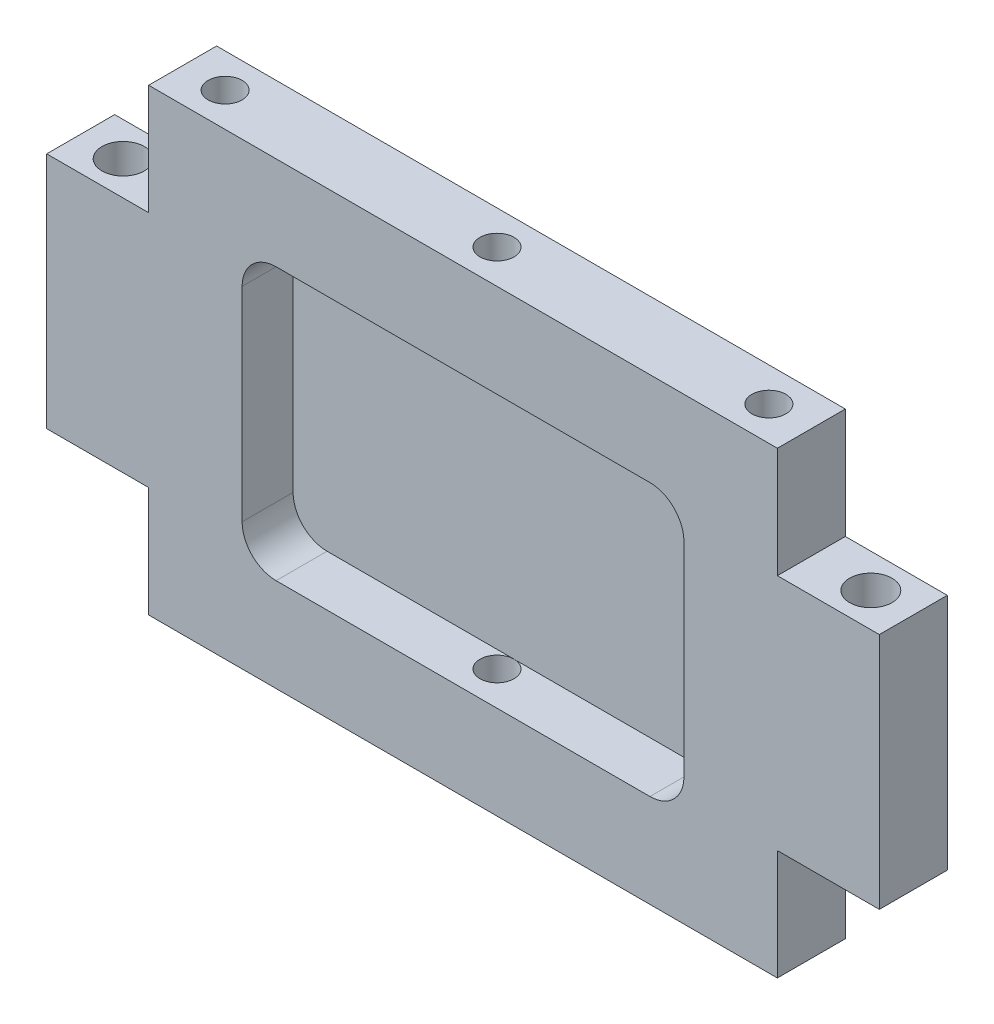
ISO-10303-21;
HEADER;
FILE_DESCRIPTION(('STEP AP214'),'2;1');
FILE_NAME('part.step','',(''),(''),'','','');
FILE_SCHEMA(('AUTOMOTIVE_DESIGN { 1 0 10303 214 1 1 1 1 }'));
ENDSEC;
DATA;
#1=APPLICATION_CONTEXT('core data for automotive mechanical design processes');
#2=APPLICATION_PROTOCOL_DEFINITION('international standard','automotive_design',2000,#1);
#3=PRODUCT_CONTEXT('',#1,'mechanical');
#4=PRODUCT('Part','Part','',(#3));
#5=PRODUCT_RELATED_PRODUCT_CATEGORY('part','',(#4));
#6=PRODUCT_DEFINITION_FORMATION('','',#4);
#7=PRODUCT_DEFINITION_CONTEXT('part definition',#1,'design');
#8=PRODUCT_DEFINITION('design','',#6,#7);
#9=PRODUCT_DEFINITION_SHAPE('','',#8);
#10=(LENGTH_UNIT() NAMED_UNIT(*) SI_UNIT(.MILLI.,.METRE.));
#11=(NAMED_UNIT(*) PLANE_ANGLE_UNIT() SI_UNIT($,.RADIAN.));
#12=(NAMED_UNIT(*) SI_UNIT($,.STERADIAN.) SOLID_ANGLE_UNIT());
#13=UNCERTAINTY_MEASURE_WITH_UNIT(LENGTH_MEASURE(1.E-05),#10,'distance_accuracy_value','');
#14=(GEOMETRIC_REPRESENTATION_CONTEXT(3) GLOBAL_UNCERTAINTY_ASSIGNED_CONTEXT((#13)) GLOBAL_UNIT_ASSIGNED_CONTEXT((#10,
#11,#12)) REPRESENTATION_CONTEXT('',''));
#15=CARTESIAN_POINT('',(0.,0.,0.));
#16=DIRECTION('',(0.,0.,1.));
#17=DIRECTION('',(1.,0.,0.));
#18=AXIS2_PLACEMENT_3D('',#15,#16,#17);
#19=CARTESIAN_POINT('',(0.,0.,6.35));
#20=DIRECTION('',(0.,0.,1.));
#21=DIRECTION('',(1.,0.,0.));
#22=AXIS2_PLACEMENT_3D('',#19,#20,#21);
#23=PLANE('',#22);
#24=DIRECTION('',(0.,-1.,0.));
#25=VECTOR('',#24,1.);
#26=CARTESIAN_POINT('',(-58.7375,-22.2377,6.35));
#27=LINE('',#26,#25);
#28=CARTESIAN_POINT('',(-58.7375,-22.2377,6.35));
#29=VERTEX_POINT('',#28);
#30=CARTESIAN_POINT('',(-58.7375,-42.8625,6.35));
#31=VERTEX_POINT('',#30);
#32=EDGE_CURVE('E236',#29,#31,#27,.T.);
#33=ORIENTED_EDGE('',*,*,#32,.T.);
#34=DIRECTION('',(1.,0.,0.));
#35=VECTOR('',#34,1.);
#36=CARTESIAN_POINT('',(-58.7375,-42.8625,6.35));
#37=LINE('',#36,#35);
#38=CARTESIAN_POINT('',(58.7375,-42.8625,6.35));
#39=VERTEX_POINT('',#38);
#40=EDGE_CURVE('E239',#31,#39,#37,.T.);
#41=ORIENTED_EDGE('',*,*,#40,.T.);
#42=DIRECTION('',(0.,1.,0.));
#43=VECTOR('',#42,1.);
#44=CARTESIAN_POINT('',(58.7375,-42.8625,6.35));
#45=LINE('',#44,#43);
#46=CARTESIAN_POINT('',(58.7375,-22.2377,6.35));
#47=VERTEX_POINT('',#46);
#48=EDGE_CURVE('E242',#39,#47,#45,.T.);
#49=ORIENTED_EDGE('',*,*,#48,.T.);
#50=DIRECTION('',(1.,0.,0.));
#51=VECTOR('',#50,1.);
#52=CARTESIAN_POINT('',(58.7375,-22.2377,6.35));
#53=LINE('',#52,#51);
#54=CARTESIAN_POINT('',(77.7875,-22.2377,6.35));
#55=VERTEX_POINT('',#54);
#56=EDGE_CURVE('E244',#47,#55,#53,.T.);
#57=ORIENTED_EDGE('',*,*,#56,.T.);
#58=DIRECTION('',(0.,1.,0.));
#59=VECTOR('',#58,1.);
#60=CARTESIAN_POINT('',(77.7875,-22.2377,6.35));
#61=LINE('',#60,#59);
#62=CARTESIAN_POINT('',(77.7875,22.2377,6.35));
#63=VERTEX_POINT('',#62);
#64=EDGE_CURVE('E246',#55,#63,#61,.T.);
#65=ORIENTED_EDGE('',*,*,#64,.T.);
#66=DIRECTION('',(-1.,0.,0.));
#67=VECTOR('',#66,1.);
#68=CARTESIAN_POINT('',(77.7875,22.2377,6.35));
#69=LINE('',#68,#67);
#70=CARTESIAN_POINT('',(58.7375,22.2377,6.35));
#71=VERTEX_POINT('',#70);
#72=EDGE_CURVE('E248',#63,#71,#69,.T.);
#73=ORIENTED_EDGE('',*,*,#72,.T.);
#74=DIRECTION('',(0.,1.,0.));
#75=VECTOR('',#74,1.);
#76=CARTESIAN_POINT('',(58.7375,22.2377,6.35));
#77=LINE('',#76,#75);
#78=CARTESIAN_POINT('',(58.7375,42.8625,6.35));
#79=VERTEX_POINT('',#78);
#80=EDGE_CURVE('E250',#71,#79,#77,.T.);
#81=ORIENTED_EDGE('',*,*,#80,.T.);
#82=DIRECTION('',(-1.,0.,0.));
#83=VECTOR('',#82,1.);
#84=CARTESIAN_POINT('',(58.7375,42.8625,6.35));
#85=LINE('',#84,#83);
#86=CARTESIAN_POINT('',(-58.7375,42.8625,6.35));
#87=VERTEX_POINT('',#86);
#88=EDGE_CURVE('E252',#79,#87,#85,.T.);
#89=ORIENTED_EDGE('',*,*,#88,.T.);
#90=DIRECTION('',(0.,-1.,0.));
#91=VECTOR('',#90,1.);
#92=CARTESIAN_POINT('',(-58.7375,42.8625,6.35));
#93=LINE('',#92,#91);
#94=CARTESIAN_POINT('',(-58.7375,22.2377,6.35));
#95=VERTEX_POINT('',#94);
#96=EDGE_CURVE('E254',#87,#95,#93,.T.);
#97=ORIENTED_EDGE('',*,*,#96,.T.);
#98=DIRECTION('',(-1.,0.,0.));
#99=VECTOR('',#98,1.);
#100=CARTESIAN_POINT('',(-58.7375,22.2377,6.35));
#101=LINE('',#100,#99);
#102=CARTESIAN_POINT('',(-77.7875,22.2377,6.35));
#103=VERTEX_POINT('',#102);
#104=EDGE_CURVE('E256',#95,#103,#101,.T.);
#105=ORIENTED_EDGE('',*,*,#104,.T.);
#106=DIRECTION('',(0.,-1.,0.));
#107=VECTOR('',#106,1.);
#108=CARTESIAN_POINT('',(-77.7875,22.2377,6.35));
#109=LINE('',#108,#107);
#110=CARTESIAN_POINT('',(-77.7875,-22.2377,6.35));
#111=VERTEX_POINT('',#110);
#112=EDGE_CURVE('E258',#103,#111,#109,.T.);
#113=ORIENTED_EDGE('',*,*,#112,.T.);
#114=DIRECTION('',(1.,0.,0.));
#115=VECTOR('',#114,1.);
#116=CARTESIAN_POINT('',(-77.7875,-22.2377,6.35));
#117=LINE('',#116,#115);
#118=EDGE_CURVE('E260',#111,#29,#117,.T.);
#119=ORIENTED_EDGE('',*,*,#118,.T.);
#120=EDGE_LOOP('',(#33,#41,#49,#57,#65,#73,#81,#89,#97,#105,#113,#119));
#121=FACE_BOUND('',#120,.T.);
#122=DIRECTION('',(-1.,0.,0.));
#123=VECTOR('',#122,1.);
#124=CARTESIAN_POINT('',(0.,-25.4,6.35));
#125=LINE('',#124,#123);
#126=CARTESIAN_POINT('',(34.925,-25.4,6.35));
#127=VERTEX_POINT('',#126);
#128=CARTESIAN_POINT('',(-34.925,-25.4,6.35));
#129=VERTEX_POINT('',#128);
#130=EDGE_CURVE('E203',#127,#129,#125,.T.);
#131=ORIENTED_EDGE('',*,*,#130,.T.);
#132=CARTESIAN_POINT('',(-34.925,-19.05,6.35));
#133=DIRECTION('',(0.,0.,1.));
#134=DIRECTION('',(1.,0.,0.));
#135=AXIS2_PLACEMENT_3D('',#132,#133,#134);
#136=CIRCLE('',#135,6.35);
#137=CARTESIAN_POINT('',(-41.275,-19.05,6.35));
#138=VERTEX_POINT('',#137);
#139=EDGE_CURVE('E41',#129,#138,#136,.F.);
#140=ORIENTED_EDGE('',*,*,#139,.T.);
#141=DIRECTION('',(0.,1.,0.));
#142=VECTOR('',#141,1.);
#143=CARTESIAN_POINT('',(-41.275,0.,6.35));
#144=LINE('',#143,#142);
#145=CARTESIAN_POINT('',(-41.275,19.05,6.35));
#146=VERTEX_POINT('',#145);
#147=EDGE_CURVE('E334',#138,#146,#144,.T.);
#148=ORIENTED_EDGE('',*,*,#147,.T.);
#149=CARTESIAN_POINT('',(-34.925,19.05,6.35));
#150=DIRECTION('',(0.,0.,1.));
#151=DIRECTION('',(1.,0.,0.));
#152=AXIS2_PLACEMENT_3D('',#149,#150,#151);
#153=CIRCLE('',#152,6.35);
#154=CARTESIAN_POINT('',(-34.925,25.4,6.35));
#155=VERTEX_POINT('',#154);
#156=EDGE_CURVE('E11',#146,#155,#153,.F.);
#157=ORIENTED_EDGE('',*,*,#156,.T.);
#158=DIRECTION('',(1.,0.,0.));
#159=VECTOR('',#158,1.);
#160=CARTESIAN_POINT('',(0.,25.4,6.35));
#161=LINE('',#160,#159);
#162=CARTESIAN_POINT('',(34.925,25.4,6.35));
#163=VERTEX_POINT('',#162);
#164=EDGE_CURVE('E378',#155,#163,#161,.T.);
#165=ORIENTED_EDGE('',*,*,#164,.T.);
#166=CARTESIAN_POINT('',(34.925,19.05,6.35));
#167=DIRECTION('',(0.,0.,1.));
#168=DIRECTION('',(1.,0.,0.));
#169=AXIS2_PLACEMENT_3D('',#166,#167,#168);
#170=CIRCLE('',#169,6.35);
#171=CARTESIAN_POINT('',(41.275,19.05,6.35));
#172=VERTEX_POINT('',#171);
#173=EDGE_CURVE('E363',#163,#172,#170,.F.);
#174=ORIENTED_EDGE('',*,*,#173,.T.);
#175=DIRECTION('',(0.,-1.,0.));
#176=VECTOR('',#175,1.);
#177=CARTESIAN_POINT('',(41.275,0.,6.35));
#178=LINE('',#177,#176);
#179=CARTESIAN_POINT('',(41.275,-19.05,6.35));
#180=VERTEX_POINT('',#179);
#181=EDGE_CURVE('E331',#172,#180,#178,.T.);
#182=ORIENTED_EDGE('',*,*,#181,.T.);
#183=CARTESIAN_POINT('',(34.925,-19.05,6.35));
#184=DIRECTION('',(0.,0.,1.));
#185=DIRECTION('',(1.,0.,0.));
#186=AXIS2_PLACEMENT_3D('',#183,#184,#185);
#187=CIRCLE('',#186,6.35);
#188=EDGE_CURVE('E365',#180,#127,#187,.F.);
#189=ORIENTED_EDGE('',*,*,#188,.T.);
#190=EDGE_LOOP('',(#131,#140,#148,#157,#165,#174,#182,#189));
#191=FACE_BOUND('',#190,.T.);
#192=ADVANCED_FACE('F33',(#121,#191),#23,.T.);
#193=CARTESIAN_POINT('',(0.,-42.8625,0.));
#194=DIRECTION('',(0.,-1.,0.));
#195=DIRECTION('',(0.,0.,-1.));
#196=AXIS2_PLACEMENT_3D('',#193,#194,#195);
#197=CYLINDRICAL_SURFACE('',#196,3.17499999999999);
#198=CARTESIAN_POINT('',(0.,-42.8625,0.));
#199=DIRECTION('',(0.,-1.,0.));
#200=DIRECTION('',(0.,0.,-1.));
#201=AXIS2_PLACEMENT_3D('',#198,#199,#200);
#202=CIRCLE('',#201,3.17499999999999);
#203=CARTESIAN_POINT('',(0.,-42.8625,-3.17499999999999));
#204=VERTEX_POINT('',#203);
#205=EDGE_CURVE('E218',#204,#204,#202,.T.);
#206=ORIENTED_EDGE('',*,*,#205,.T.);
#207=EDGE_LOOP('',(#206));
#208=FACE_BOUND('',#207,.T.);
#209=CARTESIAN_POINT('',(0.,-25.4,0.));
#210=DIRECTION('',(0.,1.,0.));
#211=DIRECTION('',(0.,0.,1.));
#212=AXIS2_PLACEMENT_3D('',#209,#210,#211);
#213=CIRCLE('',#212,3.17499999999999);
#214=CARTESIAN_POINT('',(0.,-25.4,-3.17499999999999));
#215=VERTEX_POINT('',#214);
#216=EDGE_CURVE('E328',#215,#215,#213,.F.);
#217=ORIENTED_EDGE('',*,*,#216,.F.);
#218=EDGE_LOOP('',(#217));
#219=FACE_BOUND('',#218,.T.);
#220=ADVANCED_FACE('F417',(#208,#219),#197,.F.);
#221=CARTESIAN_POINT('',(0.,42.8625,0.));
#222=DIRECTION('',(0.,1.,0.));
#223=DIRECTION('',(0.,0.,1.));
#224=AXIS2_PLACEMENT_3D('',#221,#222,#223);
#225=CYLINDRICAL_SURFACE('',#224,3.17499999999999);
#226=CARTESIAN_POINT('',(0.,42.8625,0.));
#227=DIRECTION('',(0.,1.,0.));
#228=DIRECTION('',(0.,0.,1.));
#229=AXIS2_PLACEMENT_3D('',#226,#227,#228);
#230=CIRCLE('',#229,3.17499999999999);
#231=CARTESIAN_POINT('',(0.,42.8625,3.17499999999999));
#232=VERTEX_POINT('',#231);
#233=EDGE_CURVE('E196',#232,#232,#230,.T.);
#234=ORIENTED_EDGE('',*,*,#233,.T.);
#235=EDGE_LOOP('',(#234));
#236=FACE_BOUND('',#235,.T.);
#237=CARTESIAN_POINT('',(0.,25.4,0.));
#238=DIRECTION('',(0.,-1.,0.));
#239=DIRECTION('',(0.,0.,-1.));
#240=AXIS2_PLACEMENT_3D('',#237,#238,#239);
#241=CIRCLE('',#240,3.17499999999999);
#242=CARTESIAN_POINT('',(0.,25.4,-3.17499999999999));
#243=VERTEX_POINT('',#242);
#244=EDGE_CURVE('E321',#243,#243,#241,.F.);
#245=ORIENTED_EDGE('',*,*,#244,.F.);
#246=EDGE_LOOP('',(#245));
#247=FACE_BOUND('',#246,.T.);
#248=ADVANCED_FACE('F419',(#236,#247),#225,.F.);
#249=CARTESIAN_POINT('',(-58.7375,-22.2377,6.35));
#250=DIRECTION('',(1.,0.,0.));
#251=DIRECTION('',(0.,1.,0.));
#252=AXIS2_PLACEMENT_3D('',#249,#250,#251);
#253=PLANE('',#252);
#254=DIRECTION('',(0.,-1.,0.));
#255=VECTOR('',#254,1.);
#256=CARTESIAN_POINT('',(-58.7375,-22.2377,-6.35));
#257=LINE('',#256,#255);
#258=CARTESIAN_POINT('',(-58.7375,-22.2377,-6.35));
#259=VERTEX_POINT('',#258);
#260=CARTESIAN_POINT('',(-58.7375,-42.8625,-6.35));
#261=VERTEX_POINT('',#260);
#262=EDGE_CURVE('E235',#259,#261,#257,.T.);
#263=ORIENTED_EDGE('',*,*,#262,.T.);
#264=DIRECTION('',(0.,0.,-1.));
#265=VECTOR('',#264,1.);
#266=CARTESIAN_POINT('',(-58.7375,-42.8625,6.35));
#267=LINE('',#266,#265);
#268=EDGE_CURVE('E318',#31,#261,#267,.T.);
#269=ORIENTED_EDGE('',*,*,#268,.F.);
#270=ORIENTED_EDGE('',*,*,#32,.F.);
#271=DIRECTION('',(0.,0.,-1.));
#272=VECTOR('',#271,1.);
#273=CARTESIAN_POINT('',(-58.7375,-22.2377,6.35));
#274=LINE('',#273,#272);
#275=EDGE_CURVE('E262',#29,#259,#274,.T.);
#276=ORIENTED_EDGE('',*,*,#275,.T.);
#277=EDGE_LOOP('',(#263,#269,#270,#276));
#278=FACE_BOUND('',#277,.T.);
#279=ADVANCED_FACE('F426',(#278),#253,.F.);
#280=CARTESIAN_POINT('',(-58.7375,-42.8625,6.35));
#281=DIRECTION('',(0.,1.,0.));
#282=DIRECTION('',(0.,0.,1.));
#283=AXIS2_PLACEMENT_3D('',#280,#281,#282);
#284=PLANE('',#283);
#285=CARTESIAN_POINT('',(-50.8,-42.8625,0.));
#286=DIRECTION('',(0.,-1.,0.));
#287=DIRECTION('',(0.,0.,-1.));
#288=AXIS2_PLACEMENT_3D('',#285,#286,#287);
#289=CIRCLE('',#288,3.17499999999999);
#290=CARTESIAN_POINT('',(-50.8,-42.8625,-3.17499999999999));
#291=VERTEX_POINT('',#290);
#292=EDGE_CURVE('E212',#291,#291,#289,.T.);
#293=ORIENTED_EDGE('',*,*,#292,.F.);
#294=EDGE_LOOP('',(#293));
#295=FACE_BOUND('',#294,.T.);
#296=ORIENTED_EDGE('',*,*,#205,.F.);
#297=EDGE_LOOP('',(#296));
#298=FACE_BOUND('',#297,.T.);
#299=CARTESIAN_POINT('',(50.8,-42.8625,0.));
#300=DIRECTION('',(0.,-1.,0.));
#301=DIRECTION('',(0.,0.,-1.));
#302=AXIS2_PLACEMENT_3D('',#299,#300,#301);
#303=CIRCLE('',#302,3.17499999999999);
#304=CARTESIAN_POINT('',(50.8,-42.8625,-3.17499999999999));
#305=VERTEX_POINT('',#304);
#306=EDGE_CURVE('E221',#305,#305,#303,.T.);
#307=ORIENTED_EDGE('',*,*,#306,.F.);
#308=EDGE_LOOP('',(#307));
#309=FACE_BOUND('',#308,.T.);
#310=DIRECTION('',(1.,0.,0.));
#311=VECTOR('',#310,1.);
#312=CARTESIAN_POINT('',(-58.7375,-42.8625,-6.35));
#313=LINE('',#312,#311);
#314=CARTESIAN_POINT('',(58.7375,-42.8625,-6.35));
#315=VERTEX_POINT('',#314);
#316=EDGE_CURVE('E265',#261,#315,#313,.T.);
#317=ORIENTED_EDGE('',*,*,#316,.T.);
#318=DIRECTION('',(0.,0.,-1.));
#319=VECTOR('',#318,1.);
#320=CARTESIAN_POINT('',(58.7375,-42.8625,6.35));
#321=LINE('',#320,#319);
#322=EDGE_CURVE('E315',#39,#315,#321,.T.);
#323=ORIENTED_EDGE('',*,*,#322,.F.);
#324=ORIENTED_EDGE('',*,*,#40,.F.);
#325=ORIENTED_EDGE('',*,*,#268,.T.);
#326=EDGE_LOOP('',(#317,#323,#324,#325));
#327=FACE_BOUND('',#326,.T.);
#328=ADVANCED_FACE('F495',(#295,#298,#309,#327),#284,.F.);
#329=CARTESIAN_POINT('',(58.7375,-42.8625,6.35));
#330=DIRECTION('',(-1.,0.,0.));
#331=DIRECTION('',(0.,-1.,0.));
#332=AXIS2_PLACEMENT_3D('',#329,#330,#331);
#333=PLANE('',#332);
#334=DIRECTION('',(0.,1.,0.));
#335=VECTOR('',#334,1.);
#336=CARTESIAN_POINT('',(58.7375,-42.8625,-6.35));
#337=LINE('',#336,#335);
#338=CARTESIAN_POINT('',(58.7375,-22.2377,-6.35));
#339=VERTEX_POINT('',#338);
#340=EDGE_CURVE('E267',#315,#339,#337,.T.);
#341=ORIENTED_EDGE('',*,*,#340,.T.);
#342=DIRECTION('',(0.,0.,-1.));
#343=VECTOR('',#342,1.);
#344=CARTESIAN_POINT('',(58.7375,-22.2377,6.35));
#345=LINE('',#344,#343);
#346=EDGE_CURVE('E312',#47,#339,#345,.T.);
#347=ORIENTED_EDGE('',*,*,#346,.F.);
#348=ORIENTED_EDGE('',*,*,#48,.F.);
#349=ORIENTED_EDGE('',*,*,#322,.T.);
#350=EDGE_LOOP('',(#341,#347,#348,#349));
#351=FACE_BOUND('',#350,.T.);
#352=ADVANCED_FACE('F491',(#351),#333,.F.);
#353=CARTESIAN_POINT('',(58.7375,-22.2377,6.35));
#354=DIRECTION('',(0.,1.,0.));
#355=DIRECTION('',(0.,0.,1.));
#356=AXIS2_PLACEMENT_3D('',#353,#354,#355);
#357=PLANE('',#356);
#358=CARTESIAN_POINT('',(69.85,-22.2377,0.));
#359=DIRECTION('',(0.,1.,0.));
#360=DIRECTION('',(0.,0.,1.));
#361=AXIS2_PLACEMENT_3D('',#358,#359,#360);
#362=CIRCLE('',#361,3.9624);
#363=CARTESIAN_POINT('',(69.85,-22.2377,3.9624));
#364=VERTEX_POINT('',#363);
#365=EDGE_CURVE('E228',#364,#364,#362,.T.);
#366=ORIENTED_EDGE('',*,*,#365,.T.);
#367=EDGE_LOOP('',(#366));
#368=FACE_BOUND('',#367,.T.);
#369=DIRECTION('',(1.,0.,0.));
#370=VECTOR('',#369,1.);
#371=CARTESIAN_POINT('',(58.7375,-22.2377,-6.35));
#372=LINE('',#371,#370);
#373=CARTESIAN_POINT('',(77.7875,-22.2377,-6.35));
#374=VERTEX_POINT('',#373);
#375=EDGE_CURVE('E269',#339,#374,#372,.T.);
#376=ORIENTED_EDGE('',*,*,#375,.T.);
#377=DIRECTION('',(0.,0.,-1.));
#378=VECTOR('',#377,1.);
#379=CARTESIAN_POINT('',(77.7875,-22.2377,6.35));
#380=LINE('',#379,#378);
#381=EDGE_CURVE('E309',#55,#374,#380,.T.);
#382=ORIENTED_EDGE('',*,*,#381,.F.);
#383=ORIENTED_EDGE('',*,*,#56,.F.);
#384=ORIENTED_EDGE('',*,*,#346,.T.);
#385=EDGE_LOOP('',(#376,#382,#383,#384));
#386=FACE_BOUND('',#385,.T.);
#387=ADVANCED_FACE('F487',(#368,#386),#357,.F.);
#388=CARTESIAN_POINT('',(77.7875,-22.2377,6.35));
#389=DIRECTION('',(-1.,0.,0.));
#390=DIRECTION('',(0.,0.,1.));
#391=AXIS2_PLACEMENT_3D('',#388,#389,#390);
#392=PLANE('',#391);
#393=DIRECTION('',(0.,1.,0.));
#394=VECTOR('',#393,1.);
#395=CARTESIAN_POINT('',(77.7875,-22.2377,-6.35));
#396=LINE('',#395,#394);
#397=CARTESIAN_POINT('',(77.7875,22.2377,-6.35));
#398=VERTEX_POINT('',#397);
#399=EDGE_CURVE('E271',#374,#398,#396,.T.);
#400=ORIENTED_EDGE('',*,*,#399,.T.);
#401=DIRECTION('',(0.,0.,-1.));
#402=VECTOR('',#401,1.);
#403=CARTESIAN_POINT('',(77.7875,22.2377,6.35));
#404=LINE('',#403,#402);
#405=EDGE_CURVE('E306',#63,#398,#404,.T.);
#406=ORIENTED_EDGE('',*,*,#405,.F.);
#407=ORIENTED_EDGE('',*,*,#64,.F.);
#408=ORIENTED_EDGE('',*,*,#381,.T.);
#409=EDGE_LOOP('',(#400,#406,#407,#408));
#410=FACE_BOUND('',#409,.T.);
#411=ADVANCED_FACE('F483',(#410),#392,.F.);
#412=CARTESIAN_POINT('',(77.7875,22.2377,6.35));
#413=DIRECTION('',(0.,-1.,0.));
#414=DIRECTION('',(0.,0.,-1.));
#415=AXIS2_PLACEMENT_3D('',#412,#413,#414);
#416=PLANE('',#415);
#417=CARTESIAN_POINT('',(69.85,22.2377,0.));
#418=DIRECTION('',(0.,-1.,0.));
#419=DIRECTION('',(0.,0.,-1.));
#420=AXIS2_PLACEMENT_3D('',#417,#418,#419);
#421=CIRCLE('',#420,3.9624);
#422=CARTESIAN_POINT('',(69.85,22.2377,3.9624));
#423=VERTEX_POINT('',#422);
#424=EDGE_CURVE('E227',#423,#423,#421,.T.);
#425=ORIENTED_EDGE('',*,*,#424,.T.);
#426=EDGE_LOOP('',(#425));
#427=FACE_BOUND('',#426,.T.);
#428=DIRECTION('',(-1.,0.,0.));
#429=VECTOR('',#428,1.);
#430=CARTESIAN_POINT('',(77.7875,22.2377,-6.35));
#431=LINE('',#430,#429);
#432=CARTESIAN_POINT('',(58.7375,22.2377,-6.35));
#433=VERTEX_POINT('',#432);
#434=EDGE_CURVE('E273',#398,#433,#431,.T.);
#435=ORIENTED_EDGE('',*,*,#434,.T.);
#436=DIRECTION('',(0.,0.,-1.));
#437=VECTOR('',#436,1.);
#438=CARTESIAN_POINT('',(58.7375,22.2377,6.35));
#439=LINE('',#438,#437);
#440=EDGE_CURVE('E303',#71,#433,#439,.T.);
#441=ORIENTED_EDGE('',*,*,#440,.F.);
#442=ORIENTED_EDGE('',*,*,#72,.F.);
#443=ORIENTED_EDGE('',*,*,#405,.T.);
#444=EDGE_LOOP('',(#435,#441,#442,#443));
#445=FACE_BOUND('',#444,.T.);
#446=ADVANCED_FACE('F479',(#427,#445),#416,.F.);
#447=CARTESIAN_POINT('',(58.7375,22.2377,6.35));
#448=DIRECTION('',(-1.,0.,0.));
#449=DIRECTION('',(0.,-1.,0.));
#450=AXIS2_PLACEMENT_3D('',#447,#448,#449);
#451=PLANE('',#450);
#452=DIRECTION('',(0.,1.,0.));
#453=VECTOR('',#452,1.);
#454=CARTESIAN_POINT('',(58.7375,22.2377,-6.35));
#455=LINE('',#454,#453);
#456=CARTESIAN_POINT('',(58.7375,42.8625,-6.35));
#457=VERTEX_POINT('',#456);
#458=EDGE_CURVE('E275',#433,#457,#455,.T.);
#459=ORIENTED_EDGE('',*,*,#458,.T.);
#460=DIRECTION('',(0.,0.,-1.));
#461=VECTOR('',#460,1.);
#462=CARTESIAN_POINT('',(58.7375,42.8625,6.35));
#463=LINE('',#462,#461);
#464=EDGE_CURVE('E300',#79,#457,#463,.T.);
#465=ORIENTED_EDGE('',*,*,#464,.F.);
#466=ORIENTED_EDGE('',*,*,#80,.F.);
#467=ORIENTED_EDGE('',*,*,#440,.T.);
#468=EDGE_LOOP('',(#459,#465,#466,#467));
#469=FACE_BOUND('',#468,.T.);
#470=ADVANCED_FACE('F475',(#469),#451,.F.);
#471=CARTESIAN_POINT('',(58.7375,42.8625,6.35));
#472=DIRECTION('',(0.,-1.,0.));
#473=DIRECTION('',(0.,0.,-1.));
#474=AXIS2_PLACEMENT_3D('',#471,#472,#473);
#475=PLANE('',#474);
#476=CARTESIAN_POINT('',(-50.8,42.8625,0.));
#477=DIRECTION('',(0.,1.,0.));
#478=DIRECTION('',(0.,0.,1.));
#479=AXIS2_PLACEMENT_3D('',#476,#477,#478);
#480=CIRCLE('',#479,3.17499999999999);
#481=CARTESIAN_POINT('',(-50.8,42.8625,3.17499999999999));
#482=VERTEX_POINT('',#481);
#483=EDGE_CURVE('E197',#482,#482,#480,.T.);
#484=ORIENTED_EDGE('',*,*,#483,.F.);
#485=EDGE_LOOP('',(#484));
#486=FACE_BOUND('',#485,.T.);
#487=ORIENTED_EDGE('',*,*,#233,.F.);
#488=EDGE_LOOP('',(#487));
#489=FACE_BOUND('',#488,.T.);
#490=CARTESIAN_POINT('',(50.8,42.8625,0.));
#491=DIRECTION('',(0.,1.,0.));
#492=DIRECTION('',(0.,0.,1.));
#493=AXIS2_PLACEMENT_3D('',#490,#491,#492);
#494=CIRCLE('',#493,3.17499999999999);
#495=CARTESIAN_POINT('',(50.8,42.8625,3.17499999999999));
#496=VERTEX_POINT('',#495);
#497=EDGE_CURVE('E200',#496,#496,#494,.T.);
#498=ORIENTED_EDGE('',*,*,#497,.F.);
#499=EDGE_LOOP('',(#498));
#500=FACE_BOUND('',#499,.T.);
#501=DIRECTION('',(-1.,0.,0.));
#502=VECTOR('',#501,1.);
#503=CARTESIAN_POINT('',(58.7375,42.8625,-6.35));
#504=LINE('',#503,#502);
#505=CARTESIAN_POINT('',(-58.7375,42.8625,-6.35));
#506=VERTEX_POINT('',#505);
#507=EDGE_CURVE('E277',#457,#506,#504,.T.);
#508=ORIENTED_EDGE('',*,*,#507,.T.);
#509=DIRECTION('',(0.,0.,-1.));
#510=VECTOR('',#509,1.);
#511=CARTESIAN_POINT('',(-58.7375,42.8625,6.35));
#512=LINE('',#511,#510);
#513=EDGE_CURVE('E297',#87,#506,#512,.T.);
#514=ORIENTED_EDGE('',*,*,#513,.F.);
#515=ORIENTED_EDGE('',*,*,#88,.F.);
#516=ORIENTED_EDGE('',*,*,#464,.T.);
#517=EDGE_LOOP('',(#508,#514,#515,#516));
#518=FACE_BOUND('',#517,.T.);
#519=ADVANCED_FACE('F471',(#486,#489,#500,#518),#475,.F.);
#520=CARTESIAN_POINT('',(-58.7375,42.8625,6.35));
#521=DIRECTION('',(1.,0.,0.));
#522=DIRECTION('',(0.,1.,0.));
#523=AXIS2_PLACEMENT_3D('',#520,#521,#522);
#524=PLANE('',#523);
#525=DIRECTION('',(0.,-1.,0.));
#526=VECTOR('',#525,1.);
#527=CARTESIAN_POINT('',(-58.7375,42.8625,-6.35));
#528=LINE('',#527,#526);
#529=CARTESIAN_POINT('',(-58.7375,22.2377,-6.35));
#530=VERTEX_POINT('',#529);
#531=EDGE_CURVE('E279',#506,#530,#528,.T.);
#532=ORIENTED_EDGE('',*,*,#531,.T.);
#533=DIRECTION('',(0.,0.,-1.));
#534=VECTOR('',#533,1.);
#535=CARTESIAN_POINT('',(-58.7375,22.2377,6.35));
#536=LINE('',#535,#534);
#537=EDGE_CURVE('E294',#95,#530,#536,.T.);
#538=ORIENTED_EDGE('',*,*,#537,.F.);
#539=ORIENTED_EDGE('',*,*,#96,.F.);
#540=ORIENTED_EDGE('',*,*,#513,.T.);
#541=EDGE_LOOP('',(#532,#538,#539,#540));
#542=FACE_BOUND('',#541,.T.);
#543=ADVANCED_FACE('F467',(#542),#524,.F.);
#544=CARTESIAN_POINT('',(-58.7375,22.2377,6.35));
#545=DIRECTION('',(0.,-1.,0.));
#546=DIRECTION('',(1.,0.,0.));
#547=AXIS2_PLACEMENT_3D('',#544,#545,#546);
#548=PLANE('',#547);
#549=CARTESIAN_POINT('',(-69.85,22.2377,0.));
#550=DIRECTION('',(0.,-1.,0.));
#551=DIRECTION('',(1.,0.,0.));
#552=AXIS2_PLACEMENT_3D('',#549,#550,#551);
#553=CIRCLE('',#552,3.9624);
#554=CARTESIAN_POINT('',(-69.85,22.2377,3.9624));
#555=VERTEX_POINT('',#554);
#556=EDGE_CURVE('E232',#555,#555,#553,.T.);
#557=ORIENTED_EDGE('',*,*,#556,.T.);
#558=EDGE_LOOP('',(#557));
#559=FACE_BOUND('',#558,.T.);
#560=DIRECTION('',(-1.,0.,0.));
#561=VECTOR('',#560,1.);
#562=CARTESIAN_POINT('',(-58.7375,22.2377,-6.35));
#563=LINE('',#562,#561);
#564=CARTESIAN_POINT('',(-77.7875,22.2377,-6.35));
#565=VERTEX_POINT('',#564);
#566=EDGE_CURVE('E281',#530,#565,#563,.T.);
#567=ORIENTED_EDGE('',*,*,#566,.T.);
#568=DIRECTION('',(0.,0.,-1.));
#569=VECTOR('',#568,1.);
#570=CARTESIAN_POINT('',(-77.7875,22.2377,6.35));
#571=LINE('',#570,#569);
#572=EDGE_CURVE('E291',#103,#565,#571,.T.);
#573=ORIENTED_EDGE('',*,*,#572,.F.);
#574=ORIENTED_EDGE('',*,*,#104,.F.);
#575=ORIENTED_EDGE('',*,*,#537,.T.);
#576=EDGE_LOOP('',(#567,#573,#574,#575));
#577=FACE_BOUND('',#576,.T.);
#578=ADVANCED_FACE('F463',(#559,#577),#548,.F.);
#579=CARTESIAN_POINT('',(-77.7875,22.2377,6.35));
#580=DIRECTION('',(1.,0.,0.));
#581=DIRECTION('',(0.,0.,-1.));
#582=AXIS2_PLACEMENT_3D('',#579,#580,#581);
#583=PLANE('',#582);
#584=DIRECTION('',(0.,-1.,0.));
#585=VECTOR('',#584,1.);
#586=CARTESIAN_POINT('',(-77.7875,22.2377,-6.35));
#587=LINE('',#586,#585);
#588=CARTESIAN_POINT('',(-77.7875,-22.2377,-6.35));
#589=VERTEX_POINT('',#588);
#590=EDGE_CURVE('E283',#565,#589,#587,.T.);
#591=ORIENTED_EDGE('',*,*,#590,.T.);
#592=DIRECTION('',(0.,0.,-1.));
#593=VECTOR('',#592,1.);
#594=CARTESIAN_POINT('',(-77.7875,-22.2377,6.35));
#595=LINE('',#594,#593);
#596=EDGE_CURVE('E288',#111,#589,#595,.T.);
#597=ORIENTED_EDGE('',*,*,#596,.F.);
#598=ORIENTED_EDGE('',*,*,#112,.F.);
#599=ORIENTED_EDGE('',*,*,#572,.T.);
#600=EDGE_LOOP('',(#591,#597,#598,#599));
#601=FACE_BOUND('',#600,.T.);
#602=ADVANCED_FACE('F459',(#601),#583,.F.);
#603=CARTESIAN_POINT('',(-77.7875,-22.2377,6.35));
#604=DIRECTION('',(0.,1.,0.));
#605=DIRECTION('',(-1.,0.,0.));
#606=AXIS2_PLACEMENT_3D('',#603,#604,#605);
#607=PLANE('',#606);
#608=CARTESIAN_POINT('',(-69.85,-22.2377,0.));
#609=DIRECTION('',(0.,1.,0.));
#610=DIRECTION('',(-1.,0.,0.));
#611=AXIS2_PLACEMENT_3D('',#608,#609,#610);
#612=CIRCLE('',#611,3.9624);
#613=CARTESIAN_POINT('',(-69.85,-22.2377,3.9624));
#614=VERTEX_POINT('',#613);
#615=EDGE_CURVE('E231',#614,#614,#612,.T.);
#616=ORIENTED_EDGE('',*,*,#615,.T.);
#617=EDGE_LOOP('',(#616));
#618=FACE_BOUND('',#617,.T.);
#619=DIRECTION('',(1.,0.,0.));
#620=VECTOR('',#619,1.);
#621=CARTESIAN_POINT('',(-77.7875,-22.2377,-6.35));
#622=LINE('',#621,#620);
#623=EDGE_CURVE('E240',#589,#259,#622,.T.);
#624=ORIENTED_EDGE('',*,*,#623,.T.);
#625=ORIENTED_EDGE('',*,*,#275,.F.);
#626=ORIENTED_EDGE('',*,*,#118,.F.);
#627=ORIENTED_EDGE('',*,*,#596,.T.);
#628=EDGE_LOOP('',(#624,#625,#626,#627));
#629=FACE_BOUND('',#628,.T.);
#630=ADVANCED_FACE('F455',(#618,#629),#607,.F.);
#631=CARTESIAN_POINT('',(0.,0.,-6.35));
#632=DIRECTION('',(0.,0.,1.));
#633=DIRECTION('',(1.,0.,0.));
#634=AXIS2_PLACEMENT_3D('',#631,#632,#633);
#635=PLANE('',#634);
#636=ORIENTED_EDGE('',*,*,#262,.F.);
#637=ORIENTED_EDGE('',*,*,#623,.F.);
#638=ORIENTED_EDGE('',*,*,#590,.F.);
#639=ORIENTED_EDGE('',*,*,#566,.F.);
#640=ORIENTED_EDGE('',*,*,#531,.F.);
#641=ORIENTED_EDGE('',*,*,#507,.F.);
#642=ORIENTED_EDGE('',*,*,#458,.F.);
#643=ORIENTED_EDGE('',*,*,#434,.F.);
#644=ORIENTED_EDGE('',*,*,#399,.F.);
#645=ORIENTED_EDGE('',*,*,#375,.F.);
#646=ORIENTED_EDGE('',*,*,#340,.F.);
#647=ORIENTED_EDGE('',*,*,#316,.F.);
#648=EDGE_LOOP('',(#636,#637,#638,#639,#640,#641,#642,#643,#644,#645,#646,#647));
#649=FACE_BOUND('',#648,.T.);
#650=ADVANCED_FACE('F450',(#649),#635,.F.);
#651=CARTESIAN_POINT('',(-69.85,-38.1,0.));
#652=DIRECTION('',(0.,1.,0.));
#653=DIRECTION('',(0.,0.,1.));
#654=AXIS2_PLACEMENT_3D('',#651,#652,#653);
#655=CYLINDRICAL_SURFACE('',#654,3.9624);
#656=CARTESIAN_POINT('',(-69.85,-22.2377,3.9624));
#657=CARTESIAN_POINT('',(-69.85,-21.7744145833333,3.9624));
#658=CARTESIAN_POINT('',(-69.85,-21.3111291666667,3.9624));
#659=CARTESIAN_POINT('',(-69.85,-20.3845583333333,3.9624));
#660=CARTESIAN_POINT('',(-69.85,-19.9212729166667,3.9624));
#661=CARTESIAN_POINT('',(-69.85,-18.9947020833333,3.9624));
#662=CARTESIAN_POINT('',(-69.85,-18.5314166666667,3.9624));
#663=CARTESIAN_POINT('',(-69.85,-17.6048458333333,3.9624));
#664=CARTESIAN_POINT('',(-69.85,-17.1415604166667,3.9624));
#665=CARTESIAN_POINT('',(-69.85,-16.2149895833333,3.9624));
#666=CARTESIAN_POINT('',(-69.85,-15.7517041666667,3.9624));
#667=CARTESIAN_POINT('',(-69.85,-14.8251333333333,3.9624));
#668=CARTESIAN_POINT('',(-69.85,-14.3618479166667,3.9624));
#669=CARTESIAN_POINT('',(-69.85,-13.4352770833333,3.9624));
#670=CARTESIAN_POINT('',(-69.85,-12.9719916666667,3.9624));
#671=CARTESIAN_POINT('',(-69.85,-12.0454208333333,3.9624));
#672=CARTESIAN_POINT('',(-69.85,-11.5821354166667,3.9624));
#673=CARTESIAN_POINT('',(-69.85,-10.6555645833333,3.9624));
#674=CARTESIAN_POINT('',(-69.85,-10.1922791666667,3.9624));
#675=CARTESIAN_POINT('',(-69.85,-9.26570833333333,3.9624));
#676=CARTESIAN_POINT('',(-69.85,-8.80242291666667,3.9624));
#677=CARTESIAN_POINT('',(-69.85,-7.87585208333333,3.9624));
#678=CARTESIAN_POINT('',(-69.85,-7.41256666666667,3.9624));
#679=CARTESIAN_POINT('',(-69.85,-6.48599583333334,3.9624));
#680=CARTESIAN_POINT('',(-69.85,-6.02271041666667,3.9624));
#681=CARTESIAN_POINT('',(-69.85,-5.09613958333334,3.9624));
#682=CARTESIAN_POINT('',(-69.85,-4.63285416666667,3.9624));
#683=CARTESIAN_POINT('',(-69.85,-3.70628333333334,3.9624));
#684=CARTESIAN_POINT('',(-69.85,-3.24299791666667,3.9624));
#685=CARTESIAN_POINT('',(-69.85,-2.31642708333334,3.9624));
#686=CARTESIAN_POINT('',(-69.85,-1.85314166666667,3.9624));
#687=CARTESIAN_POINT('',(-69.85,-0.926570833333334,3.9624));
#688=CARTESIAN_POINT('',(-69.85,-0.463285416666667,3.9624));
#689=CARTESIAN_POINT('',(-69.85,0.463285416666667,3.9624));
#690=CARTESIAN_POINT('',(-69.85,0.926570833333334,3.9624));
#691=CARTESIAN_POINT('',(-69.85,1.85314166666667,3.9624));
#692=CARTESIAN_POINT('',(-69.85,2.31642708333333,3.9624));
#693=CARTESIAN_POINT('',(-69.85,3.24299791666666,3.9624));
#694=CARTESIAN_POINT('',(-69.85,3.70628333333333,3.9624));
#695=CARTESIAN_POINT('',(-69.85,4.63285416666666,3.9624));
#696=CARTESIAN_POINT('',(-69.85,5.09613958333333,3.9624));
#697=CARTESIAN_POINT('',(-69.85,6.02271041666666,3.9624));
#698=CARTESIAN_POINT('',(-69.85,6.48599583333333,3.9624));
#699=CARTESIAN_POINT('',(-69.85,7.41256666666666,3.9624));
#700=CARTESIAN_POINT('',(-69.85,7.87585208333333,3.9624));
#701=CARTESIAN_POINT('',(-69.85,8.80242291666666,3.9624));
#702=CARTESIAN_POINT('',(-69.85,9.26570833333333,3.9624));
#703=CARTESIAN_POINT('',(-69.85,10.1922791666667,3.9624));
#704=CARTESIAN_POINT('',(-69.85,10.6555645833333,3.9624));
#705=CARTESIAN_POINT('',(-69.85,11.5821354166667,3.9624));
#706=CARTESIAN_POINT('',(-69.85,12.0454208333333,3.9624));
#707=CARTESIAN_POINT('',(-69.85,12.9719916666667,3.9624));
#708=CARTESIAN_POINT('',(-69.85,13.4352770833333,3.9624));
#709=CARTESIAN_POINT('',(-69.85,14.3618479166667,3.9624));
#710=CARTESIAN_POINT('',(-69.85,14.8251333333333,3.9624));
#711=CARTESIAN_POINT('',(-69.85,15.7517041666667,3.9624));
#712=CARTESIAN_POINT('',(-69.85,16.2149895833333,3.9624));
#713=CARTESIAN_POINT('',(-69.85,17.1415604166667,3.9624));
#714=CARTESIAN_POINT('',(-69.85,17.6048458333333,3.9624));
#715=CARTESIAN_POINT('',(-69.85,18.5314166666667,3.9624));
#716=CARTESIAN_POINT('',(-69.85,18.9947020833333,3.9624));
#717=CARTESIAN_POINT('',(-69.85,19.9212729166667,3.9624));
#718=CARTESIAN_POINT('',(-69.85,20.3845583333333,3.9624));
#719=CARTESIAN_POINT('',(-69.85,21.3111291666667,3.9624));
#720=CARTESIAN_POINT('',(-69.85,21.7744145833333,3.9624));
#721=CARTESIAN_POINT('',(-69.85,22.2377,3.9624));
#722=B_SPLINE_CURVE_WITH_KNOTS('',3,(#656,#657,#658,#659,#660,#661,#662,#663,#664,#665,#666,
#667,#668,#669,#670,#671,#672,#673,#674,#675,#676,#677,#678,#679,#680,#681,#682,#683,#684,#685,
#686,#687,#688,#689,#690,#691,#692,#693,#694,#695,#696,#697,#698,#699,#700,#701,#702,#703,#704,
#705,#706,#707,#708,#709,#710,#711,#712,#713,#714,#715,#716,#717,#718,#719,#720,#721),
.UNSPECIFIED.,.F.,.F.,(4,2,2,2,2,2,2,2,2,2,2,2,2,2,2,2,2,2,2,2,2,2,2,2,2,2,2,2,2,2,2,2,4),(0.,
1.38985625,2.7797125,4.16956875,5.559425,6.94928125,8.3391375,9.72899375,11.11885,12.50870625,
13.8985625,15.28841875,16.678275,18.06813125,19.4579875,20.84784375,22.2377,23.62755625,
25.0174125,26.40726875,27.797125,29.18698125,30.5768375,31.96669375,33.35655,34.74640625,
36.1362625,37.52611875,38.915975,40.30583125,41.6956875,43.08554375,44.4754),.UNSPECIFIED.);
#723=EDGE_CURVE('BSEAM447',#614,#555,#722,.T.);
#724=ORIENTED_EDGE('',*,*,#615,.F.);
#725=ORIENTED_EDGE('',*,*,#556,.F.);
#726=ORIENTED_EDGE('',*,*,#723,.T.);
#727=ORIENTED_EDGE('',*,*,#723,.F.);
#728=EDGE_LOOP('',(#724,#726,#725,#727));
#729=FACE_BOUND('',#728,.T.);
#730=ADVANCED_FACE('F447',(#729),#655,.F.);
#731=CARTESIAN_POINT('',(69.85,-38.1,0.));
#732=DIRECTION('',(0.,1.,0.));
#733=DIRECTION('',(0.,0.,1.));
#734=AXIS2_PLACEMENT_3D('',#731,#732,#733);
#735=CYLINDRICAL_SURFACE('',#734,3.9624);
#736=CARTESIAN_POINT('',(69.85,22.2377,3.9624));
#737=CARTESIAN_POINT('',(69.85,21.7744145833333,3.9624));
#738=CARTESIAN_POINT('',(69.85,21.3111291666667,3.9624));
#739=CARTESIAN_POINT('',(69.85,20.3845583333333,3.9624));
#740=CARTESIAN_POINT('',(69.85,19.9212729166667,3.9624));
#741=CARTESIAN_POINT('',(69.85,18.9947020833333,3.9624));
#742=CARTESIAN_POINT('',(69.85,18.5314166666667,3.9624));
#743=CARTESIAN_POINT('',(69.85,17.6048458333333,3.9624));
#744=CARTESIAN_POINT('',(69.85,17.1415604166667,3.9624));
#745=CARTESIAN_POINT('',(69.85,16.2149895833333,3.9624));
#746=CARTESIAN_POINT('',(69.85,15.7517041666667,3.9624));
#747=CARTESIAN_POINT('',(69.85,14.8251333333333,3.9624));
#748=CARTESIAN_POINT('',(69.85,14.3618479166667,3.9624));
#749=CARTESIAN_POINT('',(69.85,13.4352770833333,3.9624));
#750=CARTESIAN_POINT('',(69.85,12.9719916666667,3.9624));
#751=CARTESIAN_POINT('',(69.85,12.0454208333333,3.9624));
#752=CARTESIAN_POINT('',(69.85,11.5821354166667,3.9624));
#753=CARTESIAN_POINT('',(69.85,10.6555645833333,3.9624));
#754=CARTESIAN_POINT('',(69.85,10.1922791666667,3.9624));
#755=CARTESIAN_POINT('',(69.85,9.26570833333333,3.9624));
#756=CARTESIAN_POINT('',(69.85,8.80242291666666,3.9624));
#757=CARTESIAN_POINT('',(69.85,7.87585208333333,3.9624));
#758=CARTESIAN_POINT('',(69.85,7.41256666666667,3.9624));
#759=CARTESIAN_POINT('',(69.85,6.48599583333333,3.9624));
#760=CARTESIAN_POINT('',(69.85,6.02271041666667,3.9624));
#761=CARTESIAN_POINT('',(69.85,5.09613958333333,3.9624));
#762=CARTESIAN_POINT('',(69.85,4.63285416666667,3.9624));
#763=CARTESIAN_POINT('',(69.85,3.70628333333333,3.9624));
#764=CARTESIAN_POINT('',(69.85,3.24299791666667,3.9624));
#765=CARTESIAN_POINT('',(69.85,2.31642708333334,3.9624));
#766=CARTESIAN_POINT('',(69.85,1.85314166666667,3.9624));
#767=CARTESIAN_POINT('',(69.85,0.926570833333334,3.9624));
#768=CARTESIAN_POINT('',(69.85,0.463285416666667,3.9624));
#769=CARTESIAN_POINT('',(69.85,-0.463285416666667,3.9624));
#770=CARTESIAN_POINT('',(69.85,-0.926570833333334,3.9624));
#771=CARTESIAN_POINT('',(69.85,-1.85314166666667,3.9624));
#772=CARTESIAN_POINT('',(69.85,-2.31642708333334,3.9624));
#773=CARTESIAN_POINT('',(69.85,-3.24299791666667,3.9624));
#774=CARTESIAN_POINT('',(69.85,-3.70628333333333,3.9624));
#775=CARTESIAN_POINT('',(69.85,-4.63285416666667,3.9624));
#776=CARTESIAN_POINT('',(69.85,-5.09613958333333,3.9624));
#777=CARTESIAN_POINT('',(69.85,-6.02271041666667,3.9624));
#778=CARTESIAN_POINT('',(69.85,-6.48599583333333,3.9624));
#779=CARTESIAN_POINT('',(69.85,-7.41256666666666,3.9624));
#780=CARTESIAN_POINT('',(69.85,-7.87585208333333,3.9624));
#781=CARTESIAN_POINT('',(69.85,-8.80242291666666,3.9624));
#782=CARTESIAN_POINT('',(69.85,-9.26570833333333,3.9624));
#783=CARTESIAN_POINT('',(69.85,-10.1922791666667,3.9624));
#784=CARTESIAN_POINT('',(69.85,-10.6555645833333,3.9624));
#785=CARTESIAN_POINT('',(69.85,-11.5821354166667,3.9624));
#786=CARTESIAN_POINT('',(69.85,-12.0454208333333,3.9624));
#787=CARTESIAN_POINT('',(69.85,-12.9719916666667,3.9624));
#788=CARTESIAN_POINT('',(69.85,-13.4352770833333,3.9624));
#789=CARTESIAN_POINT('',(69.85,-14.3618479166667,3.9624));
#790=CARTESIAN_POINT('',(69.85,-14.8251333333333,3.9624));
#791=CARTESIAN_POINT('',(69.85,-15.7517041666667,3.9624));
#792=CARTESIAN_POINT('',(69.85,-16.2149895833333,3.9624));
#793=CARTESIAN_POINT('',(69.85,-17.1415604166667,3.9624));
#794=CARTESIAN_POINT('',(69.85,-17.6048458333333,3.9624));
#795=CARTESIAN_POINT('',(69.85,-18.5314166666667,3.9624));
#796=CARTESIAN_POINT('',(69.85,-18.9947020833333,3.9624));
#797=CARTESIAN_POINT('',(69.85,-19.9212729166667,3.9624));
#798=CARTESIAN_POINT('',(69.85,-20.3845583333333,3.9624));
#799=CARTESIAN_POINT('',(69.85,-21.3111291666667,3.9624));
#800=CARTESIAN_POINT('',(69.85,-21.7744145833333,3.9624));
#801=CARTESIAN_POINT('',(69.85,-22.2377,3.9624));
#802=B_SPLINE_CURVE_WITH_KNOTS('',3,(#736,#737,#738,#739,#740,#741,#742,#743,#744,#745,#746,
#747,#748,#749,#750,#751,#752,#753,#754,#755,#756,#757,#758,#759,#760,#761,#762,#763,#764,#765,
#766,#767,#768,#769,#770,#771,#772,#773,#774,#775,#776,#777,#778,#779,#780,#781,#782,#783,#784,
#785,#786,#787,#788,#789,#790,#791,#792,#793,#794,#795,#796,#797,#798,#799,#800,#801),
.UNSPECIFIED.,.F.,.F.,(4,2,2,2,2,2,2,2,2,2,2,2,2,2,2,2,2,2,2,2,2,2,2,2,2,2,2,2,2,2,2,2,4),(0.,
1.38985625,2.7797125,4.16956875,5.559425,6.94928125,8.3391375,9.72899375,11.11885,12.50870625,
13.8985625,15.28841875,16.678275,18.06813125,19.4579875,20.84784375,22.2377,23.62755625,
25.0174125,26.40726875,27.797125,29.18698125,30.5768375,31.96669375,33.35655,34.74640625,
36.1362625,37.52611875,38.915975,40.30583125,41.6956875,43.08554375,44.4754),.UNSPECIFIED.);
#803=EDGE_CURVE('BSEAM443',#423,#364,#802,.T.);
#804=ORIENTED_EDGE('',*,*,#424,.F.);
#805=ORIENTED_EDGE('',*,*,#365,.F.);
#806=ORIENTED_EDGE('',*,*,#803,.T.);
#807=ORIENTED_EDGE('',*,*,#803,.F.);
#808=EDGE_LOOP('',(#804,#806,#805,#807));
#809=FACE_BOUND('',#808,.T.);
#810=ADVANCED_FACE('F443',(#809),#735,.F.);
#811=CARTESIAN_POINT('',(50.8,-23.8125,0.));
#812=DIRECTION('',(0.,-1.,0.));
#813=DIRECTION('',(0.,0.,-1.));
#814=AXIS2_PLACEMENT_3D('',#811,#812,#813);
#815=CONICAL_SURFACE('',#814,3.17499999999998,1.02974425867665);
#816=CARTESIAN_POINT('',(50.8,-21.9047675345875,0.));
#817=VERTEX_POINT('',#816);
#818=VERTEX_LOOP('',#817);
#819=FACE_BOUND('',#818,.T.);
#820=CARTESIAN_POINT('',(50.8,-23.8125,0.));
#821=DIRECTION('',(0.,-1.,0.));
#822=DIRECTION('',(0.,0.,-1.));
#823=AXIS2_PLACEMENT_3D('',#820,#821,#822);
#824=CIRCLE('',#823,3.17499999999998);
#825=CARTESIAN_POINT('',(50.8,-23.8125,-3.17499999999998));
#826=VERTEX_POINT('',#825);
#827=EDGE_CURVE('E224',#826,#826,#824,.T.);
#828=ORIENTED_EDGE('',*,*,#827,.T.);
#829=EDGE_LOOP('',(#828));
#830=FACE_BOUND('',#829,.T.);
#831=ADVANCED_FACE('F439',(#819,#830),#815,.F.);
#832=CARTESIAN_POINT('',(50.8,-42.8625,0.));
#833=DIRECTION('',(0.,-1.,0.));
#834=DIRECTION('',(0.,0.,-1.));
#835=AXIS2_PLACEMENT_3D('',#832,#833,#834);
#836=CYLINDRICAL_SURFACE('',#835,3.17499999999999);
#837=ORIENTED_EDGE('',*,*,#827,.F.);
#838=EDGE_LOOP('',(#837));
#839=FACE_BOUND('',#838,.T.);
#840=ORIENTED_EDGE('',*,*,#306,.T.);
#841=EDGE_LOOP('',(#840));
#842=FACE_BOUND('',#841,.T.);
#843=ADVANCED_FACE('F436',(#839,#842),#836,.F.);
#844=CARTESIAN_POINT('',(-50.8,-23.8125,0.));
#845=DIRECTION('',(0.,-1.,0.));
#846=DIRECTION('',(0.,0.,-1.));
#847=AXIS2_PLACEMENT_3D('',#844,#845,#846);
#848=CONICAL_SURFACE('',#847,3.17499999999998,1.02974425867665);
#849=CARTESIAN_POINT('',(-50.8,-21.9047675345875,0.));
#850=VERTEX_POINT('',#849);
#851=VERTEX_LOOP('',#850);
#852=FACE_BOUND('',#851,.T.);
#853=CARTESIAN_POINT('',(-50.8,-23.8125,0.));
#854=DIRECTION('',(0.,-1.,0.));
#855=DIRECTION('',(0.,0.,-1.));
#856=AXIS2_PLACEMENT_3D('',#853,#854,#855);
#857=CIRCLE('',#856,3.17499999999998);
#858=CARTESIAN_POINT('',(-50.8,-23.8125,-3.17499999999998));
#859=VERTEX_POINT('',#858);
#860=EDGE_CURVE('E215',#859,#859,#857,.T.);
#861=ORIENTED_EDGE('',*,*,#860,.T.);
#862=EDGE_LOOP('',(#861));
#863=FACE_BOUND('',#862,.T.);
#864=ADVANCED_FACE('F434',(#852,#863),#848,.F.);
#865=CARTESIAN_POINT('',(-50.8,-42.8625,0.));
#866=DIRECTION('',(0.,-1.,0.));
#867=DIRECTION('',(0.,0.,-1.));
#868=AXIS2_PLACEMENT_3D('',#865,#866,#867);
#869=CYLINDRICAL_SURFACE('',#868,3.17499999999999);
#870=ORIENTED_EDGE('',*,*,#860,.F.);
#871=EDGE_LOOP('',(#870));
#872=FACE_BOUND('',#871,.T.);
#873=ORIENTED_EDGE('',*,*,#292,.T.);
#874=EDGE_LOOP('',(#873));
#875=FACE_BOUND('',#874,.T.);
#876=ADVANCED_FACE('F616',(#872,#875),#869,.F.);
#877=CARTESIAN_POINT('',(50.8,23.8125,0.));
#878=DIRECTION('',(0.,1.,0.));
#879=DIRECTION('',(0.,0.,1.));
#880=AXIS2_PLACEMENT_3D('',#877,#878,#879);
#881=CONICAL_SURFACE('',#880,3.17499999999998,1.02974425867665);
#882=CARTESIAN_POINT('',(50.8,21.9047675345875,0.));
#883=VERTEX_POINT('',#882);
#884=VERTEX_LOOP('',#883);
#885=FACE_BOUND('',#884,.T.);
#886=CARTESIAN_POINT('',(50.8,23.8125,0.));
#887=DIRECTION('',(0.,1.,0.));
#888=DIRECTION('',(0.,0.,1.));
#889=AXIS2_PLACEMENT_3D('',#886,#887,#888);
#890=CIRCLE('',#889,3.17499999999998);
#891=CARTESIAN_POINT('',(50.8,23.8125,3.17499999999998));
#892=VERTEX_POINT('',#891);
#893=EDGE_CURVE('E209',#892,#892,#890,.T.);
#894=ORIENTED_EDGE('',*,*,#893,.T.);
#895=EDGE_LOOP('',(#894));
#896=FACE_BOUND('',#895,.T.);
#897=ADVANCED_FACE('F607',(#885,#896),#881,.F.);
#898=CARTESIAN_POINT('',(50.8,42.8625,0.));
#899=DIRECTION('',(0.,1.,0.));
#900=DIRECTION('',(0.,0.,1.));
#901=AXIS2_PLACEMENT_3D('',#898,#899,#900);
#902=CYLINDRICAL_SURFACE('',#901,3.17499999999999);
#903=ORIENTED_EDGE('',*,*,#893,.F.);
#904=EDGE_LOOP('',(#903));
#905=FACE_BOUND('',#904,.T.);
#906=ORIENTED_EDGE('',*,*,#497,.T.);
#907=EDGE_LOOP('',(#906));
#908=FACE_BOUND('',#907,.T.);
#909=ADVANCED_FACE('F190',(#905,#908),#902,.F.);
#910=CARTESIAN_POINT('',(-50.8,23.8125,0.));
#911=DIRECTION('',(0.,1.,0.));
#912=DIRECTION('',(0.,0.,1.));
#913=AXIS2_PLACEMENT_3D('',#910,#911,#912);
#914=CONICAL_SURFACE('',#913,3.17499999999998,1.02974425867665);
#915=CARTESIAN_POINT('',(-50.8,21.9047675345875,0.));
#916=VERTEX_POINT('',#915);
#917=VERTEX_LOOP('',#916);
#918=FACE_BOUND('',#917,.T.);
#919=CARTESIAN_POINT('',(-50.8,23.8125,0.));
#920=DIRECTION('',(0.,1.,0.));
#921=DIRECTION('',(0.,0.,1.));
#922=AXIS2_PLACEMENT_3D('',#919,#920,#921);
#923=CIRCLE('',#922,3.17499999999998);
#924=CARTESIAN_POINT('',(-50.8,23.8125,3.17499999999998));
#925=VERTEX_POINT('',#924);
#926=EDGE_CURVE('E194',#925,#925,#923,.T.);
#927=ORIENTED_EDGE('',*,*,#926,.T.);
#928=EDGE_LOOP('',(#927));
#929=FACE_BOUND('',#928,.T.);
#930=ADVANCED_FACE('F186',(#918,#929),#914,.F.);
#931=CARTESIAN_POINT('',(-50.8,42.8625,0.));
#932=DIRECTION('',(0.,1.,0.));
#933=DIRECTION('',(0.,0.,1.));
#934=AXIS2_PLACEMENT_3D('',#931,#932,#933);
#935=CYLINDRICAL_SURFACE('',#934,3.17499999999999);
#936=ORIENTED_EDGE('',*,*,#926,.F.);
#937=EDGE_LOOP('',(#936));
#938=FACE_BOUND('',#937,.T.);
#939=ORIENTED_EDGE('',*,*,#483,.T.);
#940=EDGE_LOOP('',(#939));
#941=FACE_BOUND('',#940,.T.);
#942=ADVANCED_FACE('F189',(#938,#941),#935,.F.);
#943=CARTESIAN_POINT('',(-41.275,-25.4,25.4));
#944=DIRECTION('',(0.,1.,0.));
#945=DIRECTION('',(0.,0.,1.));
#946=AXIS2_PLACEMENT_3D('',#943,#944,#945);
#947=PLANE('',#946);
#948=ORIENTED_EDGE('',*,*,#130,.F.);
#949=DIRECTION('',(0.,0.,-1.));
#950=VECTOR('',#949,1.);
#951=CARTESIAN_POINT('',(34.925,-25.4,-3.175));
#952=LINE('',#951,#950);
#953=CARTESIAN_POINT('',(34.925,-25.4,-3.175));
#954=VERTEX_POINT('',#953);
#955=EDGE_CURVE('E356',#127,#954,#952,.T.);
#956=ORIENTED_EDGE('',*,*,#955,.T.);
#957=DIRECTION('',(1.,0.,0.));
#958=VECTOR('',#957,1.);
#959=CARTESIAN_POINT('',(-41.275,-25.4,-3.175));
#960=LINE('',#959,#958);
#961=EDGE_CURVE('E385',#215,#954,#960,.T.);
#962=ORIENTED_EDGE('',*,*,#961,.F.);
#963=ORIENTED_EDGE('',*,*,#216,.T.);
#964=CARTESIAN_POINT('',(-34.925,-25.4,-3.175));
#965=VERTEX_POINT('',#964);
#966=EDGE_CURVE('E389',#965,#215,#960,.T.);
#967=ORIENTED_EDGE('',*,*,#966,.F.);
#968=DIRECTION('',(0.,0.,-1.));
#969=VECTOR('',#968,1.);
#970=CARTESIAN_POINT('',(-34.925,-25.4,6.35));
#971=LINE('',#970,#969);
#972=EDGE_CURVE('E354',#965,#129,#971,.F.);
#973=ORIENTED_EDGE('',*,*,#972,.T.);
#974=EDGE_LOOP('',(#948,#956,#962,#963,#967,#973));
#975=FACE_BOUND('',#974,.T.);
#976=ADVANCED_FACE('F373',(#975),#947,.T.);
#977=CARTESIAN_POINT('',(41.275,25.4,25.4));
#978=DIRECTION('',(0.,-1.,0.));
#979=DIRECTION('',(0.,0.,-1.));
#980=AXIS2_PLACEMENT_3D('',#977,#978,#979);
#981=PLANE('',#980);
#982=DIRECTION('',(-1.,0.,0.));
#983=VECTOR('',#982,1.);
#984=CARTESIAN_POINT('',(41.275,25.4,-3.175));
#985=LINE('',#984,#983);
#986=CARTESIAN_POINT('',(34.925,25.4,-3.175));
#987=VERTEX_POINT('',#986);
#988=EDGE_CURVE('E398',#987,#243,#985,.T.);
#989=ORIENTED_EDGE('',*,*,#988,.F.);
#990=DIRECTION('',(0.,0.,-1.));
#991=VECTOR('',#990,1.);
#992=CARTESIAN_POINT('',(34.925,25.4,6.35));
#993=LINE('',#992,#991);
#994=EDGE_CURVE('E352',#987,#163,#993,.F.);
#995=ORIENTED_EDGE('',*,*,#994,.T.);
#996=ORIENTED_EDGE('',*,*,#164,.F.);
#997=DIRECTION('',(0.,0.,-1.));
#998=VECTOR('',#997,1.);
#999=CARTESIAN_POINT('',(-34.925,25.4,-3.175));
#1000=LINE('',#999,#998);
#1001=CARTESIAN_POINT('',(-34.925,25.4,-3.175));
#1002=VERTEX_POINT('',#1001);
#1003=EDGE_CURVE('E349',#155,#1002,#1000,.T.);
#1004=ORIENTED_EDGE('',*,*,#1003,.T.);
#1005=EDGE_CURVE('E399',#243,#1002,#985,.T.);
#1006=ORIENTED_EDGE('',*,*,#1005,.F.);
#1007=ORIENTED_EDGE('',*,*,#244,.T.);
#1008=EDGE_LOOP('',(#989,#995,#996,#1004,#1006,#1007));
#1009=FACE_BOUND('',#1008,.T.);
#1010=ADVANCED_FACE('F404',(#1009),#981,.T.);
#1011=CARTESIAN_POINT('',(-41.275,25.4,25.4));
#1012=DIRECTION('',(1.,0.,0.));
#1013=DIRECTION('',(0.,0.,-1.));
#1014=AXIS2_PLACEMENT_3D('',#1011,#1012,#1013);
#1015=PLANE('',#1014);
#1016=ORIENTED_EDGE('',*,*,#147,.F.);
#1017=DIRECTION('',(0.,0.,-1.));
#1018=VECTOR('',#1017,1.);
#1019=CARTESIAN_POINT('',(-41.275,-19.05,-3.175));
#1020=LINE('',#1019,#1018);
#1021=CARTESIAN_POINT('',(-41.275,-19.05,-3.175));
#1022=VERTEX_POINT('',#1021);
#1023=EDGE_CURVE('E360',#138,#1022,#1020,.T.);
#1024=ORIENTED_EDGE('',*,*,#1023,.T.);
#1025=DIRECTION('',(0.,-1.,0.));
#1026=VECTOR('',#1025,1.);
#1027=CARTESIAN_POINT('',(-41.275,25.4,-3.175));
#1028=LINE('',#1027,#1026);
#1029=CARTESIAN_POINT('',(-41.275,19.05,-3.175));
#1030=VERTEX_POINT('',#1029);
#1031=EDGE_CURVE('E395',#1030,#1022,#1028,.T.);
#1032=ORIENTED_EDGE('',*,*,#1031,.F.);
#1033=DIRECTION('',(0.,0.,-1.));
#1034=VECTOR('',#1033,1.);
#1035=CARTESIAN_POINT('',(-41.275,19.05,6.35));
#1036=LINE('',#1035,#1034);
#1037=EDGE_CURVE('E48',#1030,#146,#1036,.F.);
#1038=ORIENTED_EDGE('',*,*,#1037,.T.);
#1039=EDGE_LOOP('',(#1016,#1024,#1032,#1038));
#1040=FACE_BOUND('',#1039,.T.);
#1041=ADVANCED_FACE('F412',(#1040),#1015,.T.);
#1042=CARTESIAN_POINT('',(41.275,-25.4,25.4));
#1043=DIRECTION('',(-1.,0.,0.));
#1044=DIRECTION('',(0.,0.,1.));
#1045=AXIS2_PLACEMENT_3D('',#1042,#1043,#1044);
#1046=PLANE('',#1045);
#1047=ORIENTED_EDGE('',*,*,#181,.F.);
#1048=DIRECTION('',(0.,0.,-1.));
#1049=VECTOR('',#1048,1.);
#1050=CARTESIAN_POINT('',(41.275,19.05,-3.175));
#1051=LINE('',#1050,#1049);
#1052=CARTESIAN_POINT('',(41.275,19.05,-3.175));
#1053=VERTEX_POINT('',#1052);
#1054=EDGE_CURVE('E338',#172,#1053,#1051,.T.);
#1055=ORIENTED_EDGE('',*,*,#1054,.T.);
#1056=DIRECTION('',(0.,1.,0.));
#1057=VECTOR('',#1056,1.);
#1058=CARTESIAN_POINT('',(41.275,-25.4,-3.175));
#1059=LINE('',#1058,#1057);
#1060=CARTESIAN_POINT('',(41.275,-19.05,-3.175));
#1061=VERTEX_POINT('',#1060);
#1062=EDGE_CURVE('E384',#1061,#1053,#1059,.T.);
#1063=ORIENTED_EDGE('',*,*,#1062,.F.);
#1064=DIRECTION('',(0.,0.,-1.));
#1065=VECTOR('',#1064,1.);
#1066=CARTESIAN_POINT('',(41.275,-19.05,6.35));
#1067=LINE('',#1066,#1065);
#1068=EDGE_CURVE('E336',#1061,#180,#1067,.F.);
#1069=ORIENTED_EDGE('',*,*,#1068,.T.);
#1070=EDGE_LOOP('',(#1047,#1055,#1063,#1069));
#1071=FACE_BOUND('',#1070,.T.);
#1072=ADVANCED_FACE('F387',(#1071),#1046,.T.);
#1073=CARTESIAN_POINT('',(0.,0.,-3.175));
#1074=DIRECTION('',(0.,0.,1.));
#1075=DIRECTION('',(1.,0.,0.));
#1076=AXIS2_PLACEMENT_3D('',#1073,#1074,#1075);
#1077=PLANE('',#1076);
#1078=ORIENTED_EDGE('',*,*,#1062,.T.);
#1079=CARTESIAN_POINT('',(34.925,19.05,-3.175));
#1080=DIRECTION('',(0.,0.,1.));
#1081=DIRECTION('',(1.,0.,0.));
#1082=AXIS2_PLACEMENT_3D('',#1079,#1080,#1081);
#1083=CIRCLE('',#1082,6.35);
#1084=EDGE_CURVE('E347',#1053,#987,#1083,.T.);
#1085=ORIENTED_EDGE('',*,*,#1084,.T.);
#1086=ORIENTED_EDGE('',*,*,#988,.T.);
#1087=ORIENTED_EDGE('',*,*,#1005,.T.);
#1088=CARTESIAN_POINT('',(-34.925,19.05,-3.175));
#1089=DIRECTION('',(0.,0.,1.));
#1090=DIRECTION('',(1.,0.,0.));
#1091=AXIS2_PLACEMENT_3D('',#1088,#1089,#1090);
#1092=CIRCLE('',#1091,6.35);
#1093=EDGE_CURVE('E341',#1002,#1030,#1092,.T.);
#1094=ORIENTED_EDGE('',*,*,#1093,.T.);
#1095=ORIENTED_EDGE('',*,*,#1031,.T.);
#1096=CARTESIAN_POINT('',(-34.925,-19.05,-3.175));
#1097=DIRECTION('',(0.,0.,1.));
#1098=DIRECTION('',(1.,0.,0.));
#1099=AXIS2_PLACEMENT_3D('',#1096,#1097,#1098);
#1100=CIRCLE('',#1099,6.35);
#1101=EDGE_CURVE('E343',#1022,#965,#1100,.T.);
#1102=ORIENTED_EDGE('',*,*,#1101,.T.);
#1103=ORIENTED_EDGE('',*,*,#966,.T.);
#1104=ORIENTED_EDGE('',*,*,#961,.T.);
#1105=CARTESIAN_POINT('',(34.925,-19.05,-3.175));
#1106=DIRECTION('',(0.,0.,1.));
#1107=DIRECTION('',(1.,0.,0.));
#1108=AXIS2_PLACEMENT_3D('',#1105,#1106,#1107);
#1109=CIRCLE('',#1108,6.35);
#1110=EDGE_CURVE('E345',#954,#1061,#1109,.T.);
#1111=ORIENTED_EDGE('',*,*,#1110,.T.);
#1112=EDGE_LOOP('',(#1078,#1085,#1086,#1087,#1094,#1095,#1102,#1103,#1104,#1111));
#1113=FACE_BOUND('',#1112,.T.);
#1114=ADVANCED_FACE('F383',(#1113),#1077,.T.);
#1115=CARTESIAN_POINT('',(34.925,19.05,25.4));
#1116=DIRECTION('',(0.,0.,1.));
#1117=DIRECTION('',(1.,0.,0.));
#1118=AXIS2_PLACEMENT_3D('',#1115,#1116,#1117);
#1119=CYLINDRICAL_SURFACE('',#1118,6.35);
#1120=ORIENTED_EDGE('',*,*,#173,.F.);
#1121=ORIENTED_EDGE('',*,*,#994,.F.);
#1122=ORIENTED_EDGE('',*,*,#1084,.F.);
#1123=ORIENTED_EDGE('',*,*,#1054,.F.);
#1124=EDGE_LOOP('',(#1120,#1121,#1122,#1123));
#1125=FACE_BOUND('',#1124,.T.);
#1126=ADVANCED_FACE('F503',(#1125),#1119,.F.);
#1127=CARTESIAN_POINT('',(34.925,-19.05,25.4));
#1128=DIRECTION('',(0.,0.,1.));
#1129=DIRECTION('',(1.,0.,0.));
#1130=AXIS2_PLACEMENT_3D('',#1127,#1128,#1129);
#1131=CYLINDRICAL_SURFACE('',#1130,6.35);
#1132=ORIENTED_EDGE('',*,*,#188,.F.);
#1133=ORIENTED_EDGE('',*,*,#1068,.F.);
#1134=ORIENTED_EDGE('',*,*,#1110,.F.);
#1135=ORIENTED_EDGE('',*,*,#955,.F.);
#1136=EDGE_LOOP('',(#1132,#1133,#1134,#1135));
#1137=FACE_BOUND('',#1136,.T.);
#1138=ADVANCED_FACE('F379',(#1137),#1131,.F.);
#1139=CARTESIAN_POINT('',(-34.925,-19.05,25.4));
#1140=DIRECTION('',(0.,0.,1.));
#1141=DIRECTION('',(1.,0.,0.));
#1142=AXIS2_PLACEMENT_3D('',#1139,#1140,#1141);
#1143=CYLINDRICAL_SURFACE('',#1142,6.35);
#1144=ORIENTED_EDGE('',*,*,#139,.F.);
#1145=ORIENTED_EDGE('',*,*,#972,.F.);
#1146=ORIENTED_EDGE('',*,*,#1101,.F.);
#1147=ORIENTED_EDGE('',*,*,#1023,.F.);
#1148=EDGE_LOOP('',(#1144,#1145,#1146,#1147));
#1149=FACE_BOUND('',#1148,.T.);
#1150=ADVANCED_FACE('F414',(#1149),#1143,.F.);
#1151=CARTESIAN_POINT('',(-34.925,19.05,25.4));
#1152=DIRECTION('',(0.,0.,1.));
#1153=DIRECTION('',(1.,0.,0.));
#1154=AXIS2_PLACEMENT_3D('',#1151,#1152,#1153);
#1155=CYLINDRICAL_SURFACE('',#1154,6.35);
#1156=ORIENTED_EDGE('',*,*,#156,.F.);
#1157=ORIENTED_EDGE('',*,*,#1037,.F.);
#1158=ORIENTED_EDGE('',*,*,#1093,.F.);
#1159=ORIENTED_EDGE('',*,*,#1003,.F.);
#1160=EDGE_LOOP('',(#1156,#1157,#1158,#1159));
#1161=FACE_BOUND('',#1160,.T.);
#1162=ADVANCED_FACE('F35',(#1161),#1155,.F.);
#1163=CLOSED_SHELL('',(#192,#220,#248,#279,#328,#352,#387,#411,#446,#470,#519,#543,#578,#602,
#630,#650,#730,#810,#831,#843,#864,#876,#897,#909,#930,#942,#976,#1010,#1041,#1072,#1114,#1126,
#1138,#1150,#1162));
#1164=MANIFOLD_SOLID_BREP('B2',#1163);
#1165=ADVANCED_BREP_SHAPE_REPRESENTATION('',(#18,#1164),#14);
#1166=SHAPE_DEFINITION_REPRESENTATION(#9,#1165);
ENDSEC;
END-ISO-10303-21;
